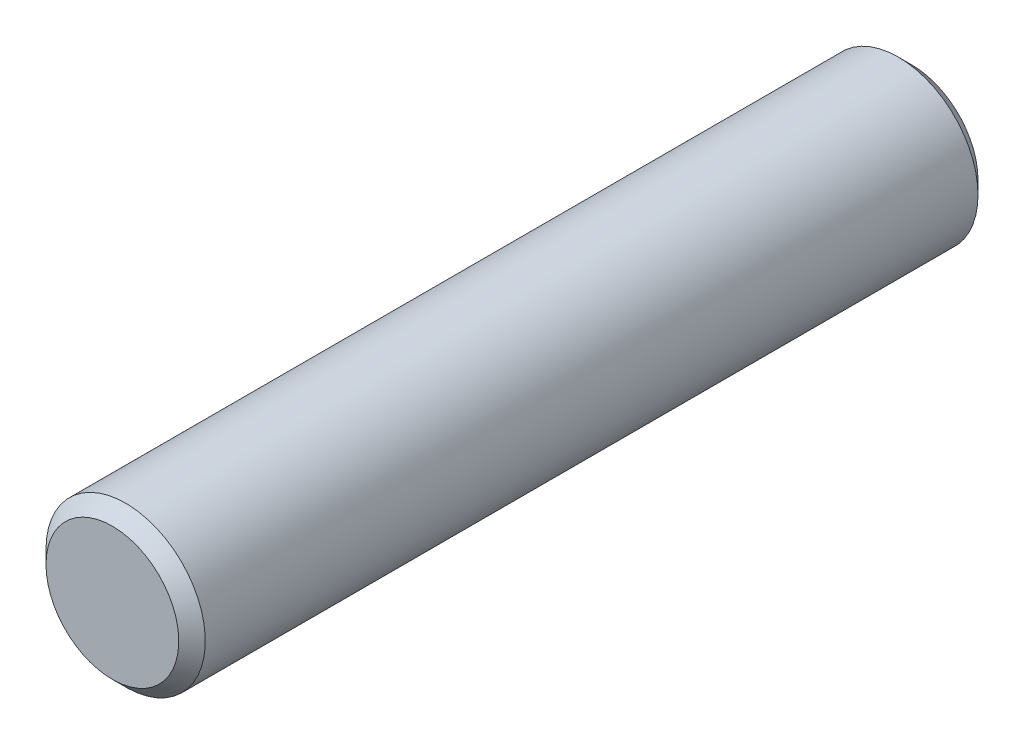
ISO-10303-21;
HEADER;
FILE_DESCRIPTION(('STEP AP214'),'2;1');
FILE_NAME('part.step','',(''),(''),'','','');
FILE_SCHEMA(('AUTOMOTIVE_DESIGN { 1 0 10303 214 1 1 1 1 }'));
ENDSEC;
DATA;
#1=APPLICATION_CONTEXT('core data for automotive mechanical design processes');
#2=APPLICATION_PROTOCOL_DEFINITION('international standard','automotive_design',2000,#1);
#3=PRODUCT_CONTEXT('',#1,'mechanical');
#4=PRODUCT('Part','Part','',(#3));
#5=PRODUCT_RELATED_PRODUCT_CATEGORY('part','',(#4));
#6=PRODUCT_DEFINITION_FORMATION('','',#4);
#7=PRODUCT_DEFINITION_CONTEXT('part definition',#1,'design');
#8=PRODUCT_DEFINITION('design','',#6,#7);
#9=PRODUCT_DEFINITION_SHAPE('','',#8);
#10=(LENGTH_UNIT() NAMED_UNIT(*) SI_UNIT(.MILLI.,.METRE.));
#11=(NAMED_UNIT(*) PLANE_ANGLE_UNIT() SI_UNIT($,.RADIAN.));
#12=(NAMED_UNIT(*) SI_UNIT($,.STERADIAN.) SOLID_ANGLE_UNIT());
#13=UNCERTAINTY_MEASURE_WITH_UNIT(LENGTH_MEASURE(1.E-05),#10,'distance_accuracy_value','');
#14=(GEOMETRIC_REPRESENTATION_CONTEXT(3) GLOBAL_UNCERTAINTY_ASSIGNED_CONTEXT((#13)) GLOBAL_UNIT_ASSIGNED_CONTEXT((#10,
#11,#12)) REPRESENTATION_CONTEXT('',''));
#15=CARTESIAN_POINT('',(0.,0.,0.));
#16=DIRECTION('',(0.,0.,1.));
#17=DIRECTION('',(1.,0.,0.));
#18=AXIS2_PLACEMENT_3D('',#15,#16,#17);
#19=CARTESIAN_POINT('',(-1.61329283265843E-13,15.,15.8926406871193));
#20=DIRECTION('',(0.,0.,-1.));
#21=DIRECTION('',(-1.,0.,0.));
#22=AXIS2_PLACEMENT_3D('',#19,#20,#21);
#23=CYLINDRICAL_SURFACE('',#22,1.5);
#24=CARTESIAN_POINT('',(-1.61329283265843E-13,15.,11.4));
#25=DIRECTION('',(0.,0.,-1.));
#26=DIRECTION('',(-1.,0.,0.));
#27=AXIS2_PLACEMENT_3D('',#24,#25,#26);
#28=CIRCLE('',#27,1.5);
#29=CARTESIAN_POINT('',(-1.50000000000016,15.,11.4));
#30=VERTEX_POINT('',#29);
#31=EDGE_CURVE('E38',#30,#30,#28,.T.);
#32=ORIENTED_EDGE('',*,*,#31,.T.);
#33=EDGE_LOOP('',(#32));
#34=FACE_BOUND('',#33,.T.);
#35=CARTESIAN_POINT('',(-1.61329283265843E-13,15.,-3.15));
#36=DIRECTION('',(0.,0.,1.));
#37=DIRECTION('',(1.,0.,0.));
#38=AXIS2_PLACEMENT_3D('',#35,#36,#37);
#39=CIRCLE('',#38,1.5);
#40=CARTESIAN_POINT('',(1.49999999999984,15.,-3.15));
#41=VERTEX_POINT('',#40);
#42=EDGE_CURVE('E42',#41,#41,#39,.T.);
#43=ORIENTED_EDGE('',*,*,#42,.T.);
#44=EDGE_LOOP('',(#43));
#45=FACE_BOUND('',#44,.T.);
#46=ADVANCED_FACE('F28',(#34,#45),#23,.T.);
#47=CARTESIAN_POINT('',(0.,15.,11.65));
#48=DIRECTION('',(0.,0.,-1.));
#49=DIRECTION('',(-0.258819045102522,-0.965925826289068,0.));
#50=AXIS2_PLACEMENT_3D('',#47,#48,#49);
#51=PLANE('',#50);
#52=CARTESIAN_POINT('',(-1.61329283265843E-13,15.,11.65));
#53=DIRECTION('',(0.,0.,-1.));
#54=DIRECTION('',(-1.,0.,0.));
#55=AXIS2_PLACEMENT_3D('',#52,#53,#54);
#56=CIRCLE('',#55,1.24999999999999);
#57=CARTESIAN_POINT('',(-1.25000000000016,15.,11.65));
#58=VERTEX_POINT('',#57);
#59=EDGE_CURVE('E34',#58,#58,#56,.F.);
#60=ORIENTED_EDGE('',*,*,#59,.T.);
#61=EDGE_LOOP('',(#60));
#62=FACE_BOUND('',#61,.T.);
#63=ADVANCED_FACE('F61',(#62),#51,.F.);
#64=CARTESIAN_POINT('',(0.,0.,-3.4));
#65=DIRECTION('',(0.,0.,1.));
#66=DIRECTION('',(0.258819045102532,-0.965925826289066,0.));
#67=AXIS2_PLACEMENT_3D('',#64,#65,#66);
#68=PLANE('',#67);
#69=CARTESIAN_POINT('',(-1.61329283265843E-13,15.,-3.4));
#70=DIRECTION('',(0.,0.,1.));
#71=DIRECTION('',(1.,0.,0.));
#72=AXIS2_PLACEMENT_3D('',#69,#70,#71);
#73=CIRCLE('',#72,1.24999999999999);
#74=CARTESIAN_POINT('',(1.24999999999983,15.,-3.4));
#75=VERTEX_POINT('',#74);
#76=EDGE_CURVE('E10',#75,#75,#73,.F.);
#77=ORIENTED_EDGE('',*,*,#76,.T.);
#78=EDGE_LOOP('',(#77));
#79=FACE_BOUND('',#78,.T.);
#80=ADVANCED_FACE('F57',(#79),#68,.F.);
#81=CARTESIAN_POINT('',(-1.61329283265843E-13,15.,11.4));
#82=DIRECTION('',(0.,0.,-1.));
#83=DIRECTION('',(-1.,0.,0.));
#84=AXIS2_PLACEMENT_3D('',#81,#82,#83);
#85=CONICAL_SURFACE('',#84,1.5,0.785398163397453);
#86=ORIENTED_EDGE('',*,*,#59,.F.);
#87=EDGE_LOOP('',(#86));
#88=FACE_BOUND('',#87,.T.);
#89=ORIENTED_EDGE('',*,*,#31,.F.);
#90=EDGE_LOOP('',(#89));
#91=FACE_BOUND('',#90,.T.);
#92=ADVANCED_FACE('F52',(#88,#91),#85,.T.);
#93=CARTESIAN_POINT('',(-1.61329283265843E-13,15.,-3.4));
#94=DIRECTION('',(0.,0.,1.));
#95=DIRECTION('',(1.,0.,0.));
#96=AXIS2_PLACEMENT_3D('',#93,#94,#95);
#97=CONICAL_SURFACE('',#96,1.24999999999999,0.785398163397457);
#98=ORIENTED_EDGE('',*,*,#42,.F.);
#99=EDGE_LOOP('',(#98));
#100=FACE_BOUND('',#99,.T.);
#101=ORIENTED_EDGE('',*,*,#76,.F.);
#102=EDGE_LOOP('',(#101));
#103=FACE_BOUND('',#102,.T.);
#104=ADVANCED_FACE('F49',(#100,#103),#97,.T.);
#105=CLOSED_SHELL('',(#46,#63,#80,#92,#104));
#106=MANIFOLD_SOLID_BREP('B2',#105);
#107=ADVANCED_BREP_SHAPE_REPRESENTATION('',(#18,#106),#14);
#108=SHAPE_DEFINITION_REPRESENTATION(#9,#107);
ENDSEC;
END-ISO-10303-21;
